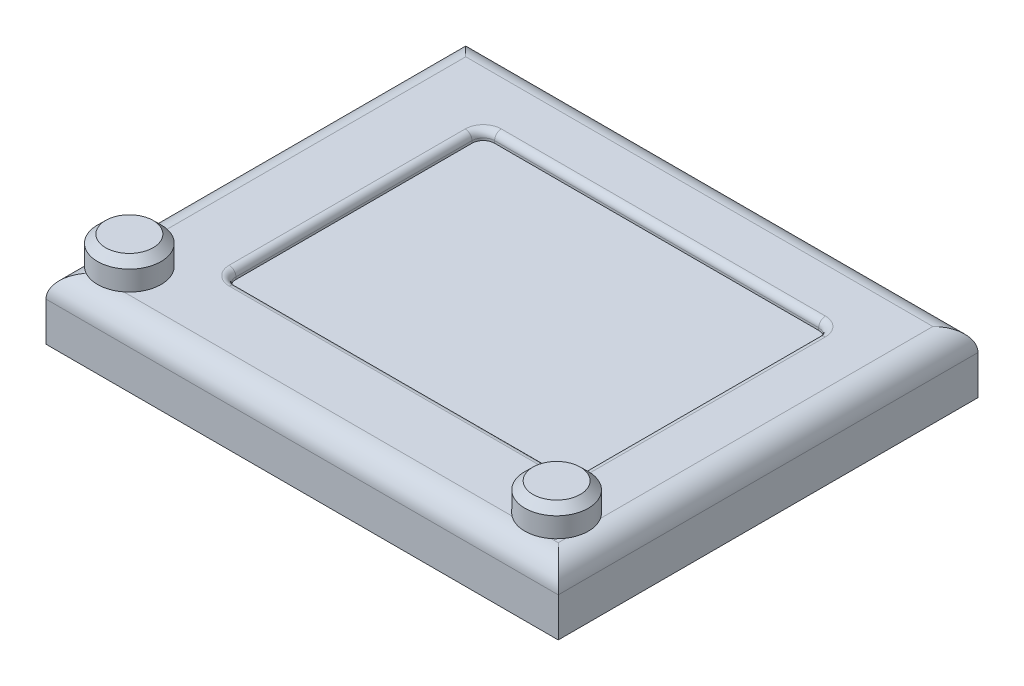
ISO-10303-21;
HEADER;
FILE_DESCRIPTION(('STEP AP214'),'2;1');
FILE_NAME('part.step','',(''),(''),'','','');
FILE_SCHEMA(('AUTOMOTIVE_DESIGN { 1 0 10303 214 1 1 1 1 }'));
ENDSEC;
DATA;
#1=APPLICATION_CONTEXT('core data for automotive mechanical design processes');
#2=APPLICATION_PROTOCOL_DEFINITION('international standard','automotive_design',2000,#1);
#3=PRODUCT_CONTEXT('',#1,'mechanical');
#4=PRODUCT('Part','Part','',(#3));
#5=PRODUCT_RELATED_PRODUCT_CATEGORY('part','',(#4));
#6=PRODUCT_DEFINITION_FORMATION('','',#4);
#7=PRODUCT_DEFINITION_CONTEXT('part definition',#1,'design');
#8=PRODUCT_DEFINITION('design','',#6,#7);
#9=PRODUCT_DEFINITION_SHAPE('','',#8);
#10=(LENGTH_UNIT() NAMED_UNIT(*) SI_UNIT(.MILLI.,.METRE.));
#11=(NAMED_UNIT(*) PLANE_ANGLE_UNIT() SI_UNIT($,.RADIAN.));
#12=(NAMED_UNIT(*) SI_UNIT($,.STERADIAN.) SOLID_ANGLE_UNIT());
#13=UNCERTAINTY_MEASURE_WITH_UNIT(LENGTH_MEASURE(1.E-05),#10,'distance_accuracy_value','');
#14=(GEOMETRIC_REPRESENTATION_CONTEXT(3) GLOBAL_UNCERTAINTY_ASSIGNED_CONTEXT((#13)) GLOBAL_UNIT_ASSIGNED_CONTEXT((#10,
#11,#12)) REPRESENTATION_CONTEXT('',''));
#15=CARTESIAN_POINT('',(0.,0.,0.));
#16=DIRECTION('',(0.,0.,1.));
#17=DIRECTION('',(1.,0.,0.));
#18=AXIS2_PLACEMENT_3D('',#15,#16,#17);
#19=CARTESIAN_POINT('',(3.8875415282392,22.58,-2.9));
#20=DIRECTION('',(0.,1.,0.));
#21=DIRECTION('',(0.,0.,1.));
#22=AXIS2_PLACEMENT_3D('',#19,#20,#21);
#23=PLANE('',#22);
#24=CARTESIAN_POINT('',(-67.9249169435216,22.58,-55.2));
#25=DIRECTION('',(0.,-1.,0.));
#26=DIRECTION('',(0.,0.,-1.));
#27=AXIS2_PLACEMENT_3D('',#24,#25,#26);
#28=CIRCLE('',#27,5.);
#29=CARTESIAN_POINT('',(-67.9249169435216,22.58,-60.2));
#30=VERTEX_POINT('',#29);
#31=CARTESIAN_POINT('',(-72.9249169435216,22.58,-55.2));
#32=VERTEX_POINT('',#31);
#33=EDGE_CURVE('P0_E108',#30,#32,#28,.F.);
#34=ORIENTED_EDGE('',*,*,#33,.T.);
#35=DIRECTION('',(0.,0.,1.));
#36=VECTOR('',#35,1.);
#37=CARTESIAN_POINT('',(-72.9249169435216,22.58,49.4));
#38=LINE('',#37,#36);
#39=CARTESIAN_POINT('',(-72.9249169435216,22.58,49.4));
#40=VERTEX_POINT('',#39);
#41=EDGE_CURVE('P0_E137',#32,#40,#38,.T.);
#42=ORIENTED_EDGE('',*,*,#41,.T.);
#43=CARTESIAN_POINT('',(-67.9249169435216,22.58,49.4));
#44=DIRECTION('',(0.,-1.,0.));
#45=DIRECTION('',(0.,0.,-1.));
#46=AXIS2_PLACEMENT_3D('',#43,#44,#45);
#47=CIRCLE('',#46,5.00000000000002);
#48=CARTESIAN_POINT('',(-67.9249169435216,22.58,54.4));
#49=VERTEX_POINT('',#48);
#50=EDGE_CURVE('P0_E103',#40,#49,#47,.F.);
#51=ORIENTED_EDGE('',*,*,#50,.T.);
#52=DIRECTION('',(1.,0.,0.));
#53=VECTOR('',#52,1.);
#54=CARTESIAN_POINT('',(75.7,22.58,54.4));
#55=LINE('',#54,#53);
#56=CARTESIAN_POINT('',(75.7,22.58,54.4));
#57=VERTEX_POINT('',#56);
#58=EDGE_CURVE('P0_E134',#49,#57,#55,.T.);
#59=ORIENTED_EDGE('',*,*,#58,.T.);
#60=CARTESIAN_POINT('',(75.7,22.58,49.4));
#61=DIRECTION('',(0.,-1.,0.));
#62=DIRECTION('',(0.,0.,-1.));
#63=AXIS2_PLACEMENT_3D('',#60,#61,#62);
#64=CIRCLE('',#63,5.);
#65=CARTESIAN_POINT('',(80.7,22.58,49.4));
#66=VERTEX_POINT('',#65);
#67=EDGE_CURVE('P0_E98',#57,#66,#64,.F.);
#68=ORIENTED_EDGE('',*,*,#67,.T.);
#69=DIRECTION('',(0.,0.,-1.));
#70=VECTOR('',#69,1.);
#71=CARTESIAN_POINT('',(80.7,22.58,-55.2));
#72=LINE('',#71,#70);
#73=CARTESIAN_POINT('',(80.7,22.58,-55.2));
#74=VERTEX_POINT('',#73);
#75=EDGE_CURVE('P0_E102',#66,#74,#72,.T.);
#76=ORIENTED_EDGE('',*,*,#75,.T.);
#77=CARTESIAN_POINT('',(75.7,22.58,-55.2));
#78=DIRECTION('',(0.,-1.,0.));
#79=DIRECTION('',(0.,0.,-1.));
#80=AXIS2_PLACEMENT_3D('',#77,#78,#79);
#81=CIRCLE('',#80,5.00000000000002);
#82=CARTESIAN_POINT('',(75.7,22.58,-60.2));
#83=VERTEX_POINT('',#82);
#84=EDGE_CURVE('P0_E113',#74,#83,#81,.F.);
#85=ORIENTED_EDGE('',*,*,#84,.T.);
#86=DIRECTION('',(-1.,0.,0.));
#87=VECTOR('',#86,1.);
#88=CARTESIAN_POINT('',(-67.9249169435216,22.58,-60.2));
#89=LINE('',#88,#87);
#90=EDGE_CURVE('P0_E142',#83,#30,#89,.T.);
#91=ORIENTED_EDGE('',*,*,#90,.T.);
#92=EDGE_LOOP('',(#34,#42,#51,#59,#68,#76,#85,#91));
#93=FACE_BOUND('',#92,.T.);
#94=ADVANCED_FACE('P0_F41',(#93),#23,.T.);
#95=CARTESIAN_POINT('',(80.7,26.58,-55.2));
#96=DIRECTION('',(1.,0.,0.));
#97=DIRECTION('',(0.,0.,-1.));
#98=AXIS2_PLACEMENT_3D('',#95,#96,#97);
#99=PLANE('',#98);
#100=DIRECTION('',(0.,-1.,0.));
#101=VECTOR('',#100,1.);
#102=CARTESIAN_POINT('',(80.7,26.58,-55.2));
#103=LINE('',#102,#101);
#104=CARTESIAN_POINT('',(80.7,23.58,-55.2));
#105=VERTEX_POINT('',#104);
#106=EDGE_CURVE('P0_E117',#105,#74,#103,.T.);
#107=ORIENTED_EDGE('',*,*,#106,.T.);
#108=ORIENTED_EDGE('',*,*,#75,.F.);
#109=DIRECTION('',(0.,-1.,0.));
#110=VECTOR('',#109,1.);
#111=CARTESIAN_POINT('',(80.7,26.58,49.4));
#112=LINE('',#111,#110);
#113=CARTESIAN_POINT('',(80.7,23.58,49.4));
#114=VERTEX_POINT('',#113);
#115=EDGE_CURVE('P0_E101',#66,#114,#112,.F.);
#116=ORIENTED_EDGE('',*,*,#115,.T.);
#117=DIRECTION('',(0.,0.,1.));
#118=VECTOR('',#117,1.);
#119=CARTESIAN_POINT('',(80.7,23.58,-27.6));
#120=LINE('',#119,#118);
#121=EDGE_CURVE('P0_E207',#105,#114,#120,.T.);
#122=ORIENTED_EDGE('',*,*,#121,.F.);
#123=EDGE_LOOP('',(#107,#108,#116,#122));
#124=FACE_BOUND('',#123,.T.);
#125=ADVANCED_FACE('P0_F484',(#124),#99,.F.);
#126=CARTESIAN_POINT('',(75.7,26.58,49.4));
#127=DIRECTION('',(0.,-1.,0.));
#128=DIRECTION('',(0.,0.,-1.));
#129=AXIS2_PLACEMENT_3D('',#126,#127,#128);
#130=CYLINDRICAL_SURFACE('',#129,5.);
#131=ORIENTED_EDGE('',*,*,#115,.F.);
#132=ORIENTED_EDGE('',*,*,#67,.F.);
#133=DIRECTION('',(0.,1.,0.));
#134=VECTOR('',#133,1.);
#135=CARTESIAN_POINT('',(75.7,26.58,54.4));
#136=LINE('',#135,#134);
#137=CARTESIAN_POINT('',(75.7,23.58,54.4));
#138=VERTEX_POINT('',#137);
#139=EDGE_CURVE('P0_E107',#57,#138,#136,.T.);
#140=ORIENTED_EDGE('',*,*,#139,.T.);
#141=CARTESIAN_POINT('',(75.7,23.58,49.4));
#142=DIRECTION('',(0.,-1.,0.));
#143=DIRECTION('',(0.,0.,-1.));
#144=AXIS2_PLACEMENT_3D('',#141,#142,#143);
#145=CIRCLE('',#144,5.);
#146=EDGE_CURVE('P0_E152',#114,#138,#145,.T.);
#147=ORIENTED_EDGE('',*,*,#146,.F.);
#148=EDGE_LOOP('',(#131,#132,#140,#147));
#149=FACE_BOUND('',#148,.T.);
#150=ADVANCED_FACE('P0_F490',(#149),#130,.F.);
#151=CARTESIAN_POINT('',(75.7,26.58,54.4));
#152=DIRECTION('',(0.,0.,1.));
#153=DIRECTION('',(1.,0.,0.));
#154=AXIS2_PLACEMENT_3D('',#151,#152,#153);
#155=PLANE('',#154);
#156=ORIENTED_EDGE('',*,*,#139,.F.);
#157=ORIENTED_EDGE('',*,*,#58,.F.);
#158=DIRECTION('',(0.,-1.,0.));
#159=VECTOR('',#158,1.);
#160=CARTESIAN_POINT('',(-67.9249169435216,26.58,54.4));
#161=LINE('',#160,#159);
#162=CARTESIAN_POINT('',(-67.9249169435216,23.58,54.4));
#163=VERTEX_POINT('',#162);
#164=EDGE_CURVE('P0_E106',#49,#163,#161,.F.);
#165=ORIENTED_EDGE('',*,*,#164,.T.);
#166=DIRECTION('',(-1.,0.,0.));
#167=VECTOR('',#166,1.);
#168=CARTESIAN_POINT('',(37.85,23.58,54.4));
#169=LINE('',#168,#167);
#170=EDGE_CURVE('P0_E163',#138,#163,#169,.T.);
#171=ORIENTED_EDGE('',*,*,#170,.F.);
#172=EDGE_LOOP('',(#156,#157,#165,#171));
#173=FACE_BOUND('',#172,.T.);
#174=ADVANCED_FACE('P0_F493',(#173),#155,.F.);
#175=CARTESIAN_POINT('',(-67.9249169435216,26.58,49.4));
#176=DIRECTION('',(0.,-1.,0.));
#177=DIRECTION('',(0.,0.,-1.));
#178=AXIS2_PLACEMENT_3D('',#175,#176,#177);
#179=CYLINDRICAL_SURFACE('',#178,5.00000000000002);
#180=ORIENTED_EDGE('',*,*,#164,.F.);
#181=ORIENTED_EDGE('',*,*,#50,.F.);
#182=DIRECTION('',(0.,1.,0.));
#183=VECTOR('',#182,1.);
#184=CARTESIAN_POINT('',(-72.9249169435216,26.58,49.4));
#185=LINE('',#184,#183);
#186=CARTESIAN_POINT('',(-72.9249169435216,23.58,49.4));
#187=VERTEX_POINT('',#186);
#188=EDGE_CURVE('P0_E112',#40,#187,#185,.T.);
#189=ORIENTED_EDGE('',*,*,#188,.T.);
#190=CARTESIAN_POINT('',(-67.9249169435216,23.58,49.4));
#191=DIRECTION('',(0.,-1.,0.));
#192=DIRECTION('',(0.,0.,-1.));
#193=AXIS2_PLACEMENT_3D('',#190,#191,#192);
#194=CIRCLE('',#193,5.00000000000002);
#195=EDGE_CURVE('P0_E173',#163,#187,#194,.T.);
#196=ORIENTED_EDGE('',*,*,#195,.F.);
#197=EDGE_LOOP('',(#180,#181,#189,#196));
#198=FACE_BOUND('',#197,.T.);
#199=ADVANCED_FACE('P0_F498',(#198),#179,.F.);
#200=CARTESIAN_POINT('',(-72.9249169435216,26.58,49.4));
#201=DIRECTION('',(-1.,0.,0.));
#202=DIRECTION('',(0.,0.,1.));
#203=AXIS2_PLACEMENT_3D('',#200,#201,#202);
#204=PLANE('',#203);
#205=ORIENTED_EDGE('',*,*,#188,.F.);
#206=ORIENTED_EDGE('',*,*,#41,.F.);
#207=DIRECTION('',(0.,-1.,0.));
#208=VECTOR('',#207,1.);
#209=CARTESIAN_POINT('',(-72.9249169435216,26.58,-55.2));
#210=LINE('',#209,#208);
#211=CARTESIAN_POINT('',(-72.9249169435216,23.58,-55.2));
#212=VERTEX_POINT('',#211);
#213=EDGE_CURVE('P0_E111',#32,#212,#210,.F.);
#214=ORIENTED_EDGE('',*,*,#213,.T.);
#215=DIRECTION('',(0.,0.,-1.));
#216=VECTOR('',#215,1.);
#217=CARTESIAN_POINT('',(-72.9249169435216,23.58,24.7));
#218=LINE('',#217,#216);
#219=EDGE_CURVE('P0_E183',#187,#212,#218,.T.);
#220=ORIENTED_EDGE('',*,*,#219,.F.);
#221=EDGE_LOOP('',(#205,#206,#214,#220));
#222=FACE_BOUND('',#221,.T.);
#223=ADVANCED_FACE('P0_F657',(#222),#204,.F.);
#224=CARTESIAN_POINT('',(-67.9249169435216,26.58,-55.2));
#225=DIRECTION('',(0.,-1.,0.));
#226=DIRECTION('',(0.,0.,-1.));
#227=AXIS2_PLACEMENT_3D('',#224,#225,#226);
#228=CYLINDRICAL_SURFACE('',#227,5.);
#229=ORIENTED_EDGE('',*,*,#213,.F.);
#230=ORIENTED_EDGE('',*,*,#33,.F.);
#231=DIRECTION('',(0.,1.,0.));
#232=VECTOR('',#231,1.);
#233=CARTESIAN_POINT('',(-67.9249169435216,26.58,-60.2));
#234=LINE('',#233,#232);
#235=CARTESIAN_POINT('',(-67.9249169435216,23.58,-60.2));
#236=VERTEX_POINT('',#235);
#237=EDGE_CURVE('P0_E145',#30,#236,#234,.T.);
#238=ORIENTED_EDGE('',*,*,#237,.T.);
#239=CARTESIAN_POINT('',(-67.9249169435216,23.58,-55.2));
#240=DIRECTION('',(0.,-1.,0.));
#241=DIRECTION('',(0.,0.,-1.));
#242=AXIS2_PLACEMENT_3D('',#239,#240,#241);
#243=CIRCLE('',#242,5.);
#244=EDGE_CURVE('P0_E193',#212,#236,#243,.T.);
#245=ORIENTED_EDGE('',*,*,#244,.F.);
#246=EDGE_LOOP('',(#229,#230,#238,#245));
#247=FACE_BOUND('',#246,.T.);
#248=ADVANCED_FACE('P0_F648',(#247),#228,.F.);
#249=CARTESIAN_POINT('',(-67.9249169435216,26.58,-60.2));
#250=DIRECTION('',(0.,0.,-1.));
#251=DIRECTION('',(-1.,0.,0.));
#252=AXIS2_PLACEMENT_3D('',#249,#250,#251);
#253=PLANE('',#252);
#254=ORIENTED_EDGE('',*,*,#237,.F.);
#255=ORIENTED_EDGE('',*,*,#90,.F.);
#256=DIRECTION('',(0.,-1.,0.));
#257=VECTOR('',#256,1.);
#258=CARTESIAN_POINT('',(75.7,26.58,-60.2));
#259=LINE('',#258,#257);
#260=CARTESIAN_POINT('',(75.7,23.58,-60.2));
#261=VERTEX_POINT('',#260);
#262=EDGE_CURVE('P0_E116',#83,#261,#259,.F.);
#263=ORIENTED_EDGE('',*,*,#262,.T.);
#264=DIRECTION('',(1.,0.,0.));
#265=VECTOR('',#264,1.);
#266=CARTESIAN_POINT('',(-33.9624584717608,23.58,-60.2));
#267=LINE('',#266,#265);
#268=EDGE_CURVE('P0_E223',#236,#261,#267,.T.);
#269=ORIENTED_EDGE('',*,*,#268,.F.);
#270=EDGE_LOOP('',(#254,#255,#263,#269));
#271=FACE_BOUND('',#270,.T.);
#272=ADVANCED_FACE('P0_F640',(#271),#253,.F.);
#273=CARTESIAN_POINT('',(75.7,26.58,-55.2));
#274=DIRECTION('',(0.,-1.,0.));
#275=DIRECTION('',(0.,0.,-1.));
#276=AXIS2_PLACEMENT_3D('',#273,#274,#275);
#277=CYLINDRICAL_SURFACE('',#276,5.00000000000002);
#278=ORIENTED_EDGE('',*,*,#262,.F.);
#279=ORIENTED_EDGE('',*,*,#84,.F.);
#280=ORIENTED_EDGE('',*,*,#106,.F.);
#281=CARTESIAN_POINT('',(75.7,23.58,-55.2));
#282=DIRECTION('',(0.,-1.,0.));
#283=DIRECTION('',(0.,0.,-1.));
#284=AXIS2_PLACEMENT_3D('',#281,#282,#283);
#285=CIRCLE('',#284,5.00000000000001);
#286=EDGE_CURVE('P0_E212',#261,#105,#285,.T.);
#287=ORIENTED_EDGE('',*,*,#286,.F.);
#288=EDGE_LOOP('',(#278,#279,#280,#287));
#289=FACE_BOUND('',#288,.T.);
#290=ADVANCED_FACE('P0_F632',(#289),#277,.F.);
#291=CARTESIAN_POINT('',(83.7,23.58,-27.6));
#292=DIRECTION('',(0.,0.,1.));
#293=DIRECTION('',(1.,0.,0.));
#294=AXIS2_PLACEMENT_3D('',#291,#292,#293);
#295=CYLINDRICAL_SURFACE('',#294,3.);
#296=CARTESIAN_POINT('',(83.7,23.58,49.4));
#297=DIRECTION('',(0.,0.,1.));
#298=DIRECTION('',(1.,0.,0.));
#299=AXIS2_PLACEMENT_3D('',#296,#297,#298);
#300=CIRCLE('',#299,3.);
#301=CARTESIAN_POINT('',(83.7,26.58,49.4));
#302=VERTEX_POINT('',#301);
#303=EDGE_CURVE('P0_E156',#302,#114,#300,.T.);
#304=ORIENTED_EDGE('',*,*,#303,.F.);
#305=DIRECTION('',(0.,0.,1.));
#306=VECTOR('',#305,1.);
#307=CARTESIAN_POINT('',(83.7,26.58,0.));
#308=LINE('',#307,#306);
#309=CARTESIAN_POINT('',(83.7,26.58,-55.2));
#310=VERTEX_POINT('',#309);
#311=EDGE_CURVE('P0_E215',#310,#302,#308,.T.);
#312=ORIENTED_EDGE('',*,*,#311,.F.);
#313=CARTESIAN_POINT('',(83.7,23.58,-55.2));
#314=DIRECTION('',(0.,0.,1.));
#315=DIRECTION('',(1.,0.,0.));
#316=AXIS2_PLACEMENT_3D('',#313,#314,#315);
#317=CIRCLE('',#316,3.);
#318=EDGE_CURVE('P0_E226',#105,#310,#317,.F.);
#319=ORIENTED_EDGE('',*,*,#318,.F.);
#320=ORIENTED_EDGE('',*,*,#121,.T.);
#321=EDGE_LOOP('',(#304,#312,#319,#320));
#322=FACE_BOUND('',#321,.T.);
#323=ADVANCED_FACE('P0_F248',(#322),#295,.T.);
#324=CARTESIAN_POINT('',(75.7,23.58,49.4));
#325=DIRECTION('',(0.,-1.,0.));
#326=DIRECTION('',(0.,0.,-1.));
#327=AXIS2_PLACEMENT_3D('',#324,#325,#326);
#328=TOROIDAL_SURFACE('',#327,8.,3.);
#329=ORIENTED_EDGE('',*,*,#303,.T.);
#330=ORIENTED_EDGE('',*,*,#146,.T.);
#331=CARTESIAN_POINT('',(75.7,23.58,57.4));
#332=DIRECTION('',(-1.,0.,0.));
#333=DIRECTION('',(0.,0.,1.));
#334=AXIS2_PLACEMENT_3D('',#331,#332,#333);
#335=CIRCLE('',#334,3.);
#336=CARTESIAN_POINT('',(75.7,26.58,57.4));
#337=VERTEX_POINT('',#336);
#338=EDGE_CURVE('P0_E155',#337,#138,#335,.T.);
#339=ORIENTED_EDGE('',*,*,#338,.F.);
#340=CARTESIAN_POINT('',(75.7,26.58,49.4));
#341=DIRECTION('',(0.,1.,0.));
#342=DIRECTION('',(0.,0.,1.));
#343=AXIS2_PLACEMENT_3D('',#340,#341,#342);
#344=CIRCLE('',#343,7.99999999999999);
#345=EDGE_CURVE('P0_E344',#302,#337,#344,.F.);
#346=ORIENTED_EDGE('',*,*,#345,.F.);
#347=EDGE_LOOP('',(#329,#330,#339,#346));
#348=FACE_BOUND('',#347,.T.);
#349=ADVANCED_FACE('P0_F237',(#348),#328,.T.);
#350=CARTESIAN_POINT('',(37.85,23.58,57.4));
#351=DIRECTION('',(-1.,0.,0.));
#352=DIRECTION('',(0.,0.,1.));
#353=AXIS2_PLACEMENT_3D('',#350,#351,#352);
#354=CYLINDRICAL_SURFACE('',#353,3.);
#355=ORIENTED_EDGE('',*,*,#338,.T.);
#356=ORIENTED_EDGE('',*,*,#170,.T.);
#357=CARTESIAN_POINT('',(-67.9249169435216,23.58,57.4));
#358=DIRECTION('',(-1.,0.,0.));
#359=DIRECTION('',(0.,0.,1.));
#360=AXIS2_PLACEMENT_3D('',#357,#358,#359);
#361=CIRCLE('',#360,3.);
#362=CARTESIAN_POINT('',(-67.9249169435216,26.58,57.4));
#363=VERTEX_POINT('',#362);
#364=EDGE_CURVE('P0_E166',#363,#163,#361,.T.);
#365=ORIENTED_EDGE('',*,*,#364,.F.);
#366=DIRECTION('',(1.,0.,0.));
#367=VECTOR('',#366,1.);
#368=CARTESIAN_POINT('',(0.,26.58,57.4));
#369=LINE('',#368,#367);
#370=EDGE_CURVE('P0_E347',#337,#363,#369,.F.);
#371=ORIENTED_EDGE('',*,*,#370,.F.);
#372=EDGE_LOOP('',(#355,#356,#365,#371));
#373=FACE_BOUND('',#372,.T.);
#374=ADVANCED_FACE('P0_F247',(#373),#354,.T.);
#375=CARTESIAN_POINT('',(-67.9249169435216,23.58,49.4));
#376=DIRECTION('',(0.,-1.,0.));
#377=DIRECTION('',(0.,0.,-1.));
#378=AXIS2_PLACEMENT_3D('',#375,#376,#377);
#379=TOROIDAL_SURFACE('',#378,8.00000000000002,3.);
#380=ORIENTED_EDGE('',*,*,#364,.T.);
#381=ORIENTED_EDGE('',*,*,#195,.T.);
#382=CARTESIAN_POINT('',(-75.9249169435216,23.58,49.4));
#383=DIRECTION('',(0.,0.,-1.));
#384=DIRECTION('',(-1.,0.,0.));
#385=AXIS2_PLACEMENT_3D('',#382,#383,#384);
#386=CIRCLE('',#385,3.);
#387=CARTESIAN_POINT('',(-75.9249169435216,26.58,49.4));
#388=VERTEX_POINT('',#387);
#389=EDGE_CURVE('P0_E176',#388,#187,#386,.T.);
#390=ORIENTED_EDGE('',*,*,#389,.F.);
#391=CARTESIAN_POINT('',(-67.9249169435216,26.58,49.4));
#392=DIRECTION('',(0.,1.,0.));
#393=DIRECTION('',(-1.,0.,0.));
#394=AXIS2_PLACEMENT_3D('',#391,#392,#393);
#395=CIRCLE('',#394,8.00000000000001);
#396=EDGE_CURVE('P0_E350',#363,#388,#395,.F.);
#397=ORIENTED_EDGE('',*,*,#396,.F.);
#398=EDGE_LOOP('',(#380,#381,#390,#397));
#399=FACE_BOUND('',#398,.T.);
#400=ADVANCED_FACE('P0_F267',(#399),#379,.T.);
#401=CARTESIAN_POINT('',(-75.9249169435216,23.58,24.7));
#402=DIRECTION('',(0.,0.,-1.));
#403=DIRECTION('',(-1.,0.,0.));
#404=AXIS2_PLACEMENT_3D('',#401,#402,#403);
#405=CYLINDRICAL_SURFACE('',#404,3.);
#406=ORIENTED_EDGE('',*,*,#389,.T.);
#407=ORIENTED_EDGE('',*,*,#219,.T.);
#408=CARTESIAN_POINT('',(-75.9249169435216,23.58,-55.2));
#409=DIRECTION('',(0.,0.,-1.));
#410=DIRECTION('',(-1.,0.,0.));
#411=AXIS2_PLACEMENT_3D('',#408,#409,#410);
#412=CIRCLE('',#411,3.);
#413=CARTESIAN_POINT('',(-75.9249169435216,26.58,-55.2));
#414=VERTEX_POINT('',#413);
#415=EDGE_CURVE('P0_E186',#414,#212,#412,.T.);
#416=ORIENTED_EDGE('',*,*,#415,.F.);
#417=DIRECTION('',(0.,0.,1.));
#418=VECTOR('',#417,1.);
#419=CARTESIAN_POINT('',(-75.9249169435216,26.58,0.));
#420=LINE('',#419,#418);
#421=EDGE_CURVE('P0_E353',#388,#414,#420,.F.);
#422=ORIENTED_EDGE('',*,*,#421,.F.);
#423=EDGE_LOOP('',(#406,#407,#416,#422));
#424=FACE_BOUND('',#423,.T.);
#425=ADVANCED_FACE('P0_F276',(#424),#405,.T.);
#426=CARTESIAN_POINT('',(-67.9249169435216,23.58,-55.2));
#427=DIRECTION('',(0.,-1.,0.));
#428=DIRECTION('',(0.,0.,-1.));
#429=AXIS2_PLACEMENT_3D('',#426,#427,#428);
#430=TOROIDAL_SURFACE('',#429,8.,3.);
#431=ORIENTED_EDGE('',*,*,#415,.T.);
#432=ORIENTED_EDGE('',*,*,#244,.T.);
#433=CARTESIAN_POINT('',(-67.9249169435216,23.58,-63.2));
#434=DIRECTION('',(1.,0.,0.));
#435=DIRECTION('',(0.,0.,-1.));
#436=AXIS2_PLACEMENT_3D('',#433,#434,#435);
#437=CIRCLE('',#436,3.);
#438=CARTESIAN_POINT('',(-67.9249169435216,26.58,-63.2));
#439=VERTEX_POINT('',#438);
#440=EDGE_CURVE('P0_E196',#439,#236,#437,.T.);
#441=ORIENTED_EDGE('',*,*,#440,.F.);
#442=CARTESIAN_POINT('',(-67.9249169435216,26.58,-55.2));
#443=DIRECTION('',(0.,1.,0.));
#444=DIRECTION('',(0.,0.,-1.));
#445=AXIS2_PLACEMENT_3D('',#442,#443,#444);
#446=CIRCLE('',#445,8.);
#447=EDGE_CURVE('P0_E356',#414,#439,#446,.F.);
#448=ORIENTED_EDGE('',*,*,#447,.F.);
#449=EDGE_LOOP('',(#431,#432,#441,#448));
#450=FACE_BOUND('',#449,.T.);
#451=ADVANCED_FACE('P0_F294',(#450),#430,.T.);
#452=CARTESIAN_POINT('',(-33.9624584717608,23.58,-63.2));
#453=DIRECTION('',(1.,0.,0.));
#454=DIRECTION('',(0.,0.,-1.));
#455=AXIS2_PLACEMENT_3D('',#452,#453,#454);
#456=CYLINDRICAL_SURFACE('',#455,3.);
#457=ORIENTED_EDGE('',*,*,#440,.T.);
#458=ORIENTED_EDGE('',*,*,#268,.T.);
#459=CARTESIAN_POINT('',(75.7,23.58,-63.2));
#460=DIRECTION('',(1.,0.,0.));
#461=DIRECTION('',(0.,0.,-1.));
#462=AXIS2_PLACEMENT_3D('',#459,#460,#461);
#463=CIRCLE('',#462,3.);
#464=CARTESIAN_POINT('',(75.7,26.58,-63.2));
#465=VERTEX_POINT('',#464);
#466=EDGE_CURVE('P0_E216',#465,#261,#463,.T.);
#467=ORIENTED_EDGE('',*,*,#466,.F.);
#468=DIRECTION('',(1.,0.,0.));
#469=VECTOR('',#468,1.);
#470=CARTESIAN_POINT('',(0.,26.58,-63.2));
#471=LINE('',#470,#469);
#472=EDGE_CURVE('P0_E359',#439,#465,#471,.T.);
#473=ORIENTED_EDGE('',*,*,#472,.F.);
#474=EDGE_LOOP('',(#457,#458,#467,#473));
#475=FACE_BOUND('',#474,.T.);
#476=ADVANCED_FACE('P0_F303',(#475),#456,.T.);
#477=CARTESIAN_POINT('',(75.7,23.58,-55.2));
#478=DIRECTION('',(0.,-1.,0.));
#479=DIRECTION('',(0.,0.,-1.));
#480=AXIS2_PLACEMENT_3D('',#477,#478,#479);
#481=TOROIDAL_SURFACE('',#480,8.00000000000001,3.);
#482=ORIENTED_EDGE('',*,*,#466,.T.);
#483=ORIENTED_EDGE('',*,*,#286,.T.);
#484=ORIENTED_EDGE('',*,*,#318,.T.);
#485=CARTESIAN_POINT('',(75.7,26.58,-55.2));
#486=DIRECTION('',(0.,1.,0.));
#487=DIRECTION('',(1.,0.,0.));
#488=AXIS2_PLACEMENT_3D('',#485,#486,#487);
#489=CIRCLE('',#488,8.00000000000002);
#490=EDGE_CURVE('P0_E362',#465,#310,#489,.F.);
#491=ORIENTED_EDGE('',*,*,#490,.F.);
#492=EDGE_LOOP('',(#482,#483,#484,#491));
#493=FACE_BOUND('',#492,.T.);
#494=ADVANCED_FACE('P0_F325',(#493),#481,.T.);
#495=CARTESIAN_POINT('',(0.,26.58,0.));
#496=DIRECTION('',(0.,1.,0.));
#497=DIRECTION('',(0.,0.,1.));
#498=AXIS2_PLACEMENT_3D('',#495,#496,#497);
#499=PLANE('',#498);
#500=ORIENTED_EDGE('',*,*,#472,.T.);
#501=ORIENTED_EDGE('',*,*,#490,.T.);
#502=ORIENTED_EDGE('',*,*,#311,.T.);
#503=ORIENTED_EDGE('',*,*,#345,.T.);
#504=ORIENTED_EDGE('',*,*,#370,.T.);
#505=ORIENTED_EDGE('',*,*,#396,.T.);
#506=ORIENTED_EDGE('',*,*,#421,.T.);
#507=ORIENTED_EDGE('',*,*,#447,.T.);
#508=EDGE_LOOP('',(#500,#501,#502,#503,#504,#505,#506,#507));
#509=FACE_BOUND('',#508,.T.);
#510=DIRECTION('',(0.,0.,1.));
#511=VECTOR('',#510,1.);
#512=CARTESIAN_POINT('',(-103.5,26.58,-46.5));
#513=LINE('',#512,#511);
#514=CARTESIAN_POINT('',(-103.5,26.58,83.));
#515=VERTEX_POINT('',#514);
#516=CARTESIAN_POINT('',(-103.5,26.58,-83.));
#517=VERTEX_POINT('',#516);
#518=EDGE_CURVE('P0_E122',#515,#517,#513,.F.);
#519=ORIENTED_EDGE('',*,*,#518,.F.);
#520=DIRECTION('',(1.,0.,0.));
#521=VECTOR('',#520,1.);
#522=CARTESIAN_POINT('',(-56.75,26.58,83.));
#523=LINE('',#522,#521);
#524=CARTESIAN_POINT('',(103.5,26.58,83.));
#525=VERTEX_POINT('',#524);
#526=EDGE_CURVE('P0_E121',#525,#515,#523,.F.);
#527=ORIENTED_EDGE('',*,*,#526,.F.);
#528=DIRECTION('',(0.,0.,-1.));
#529=VECTOR('',#528,1.);
#530=CARTESIAN_POINT('',(103.5,26.58,46.5));
#531=LINE('',#530,#529);
#532=CARTESIAN_POINT('',(103.5,26.58,-83.));
#533=VERTEX_POINT('',#532);
#534=EDGE_CURVE('P0_E126',#533,#525,#531,.F.);
#535=ORIENTED_EDGE('',*,*,#534,.F.);
#536=DIRECTION('',(-1.,0.,0.));
#537=VECTOR('',#536,1.);
#538=CARTESIAN_POINT('',(56.75,26.58,-83.));
#539=LINE('',#538,#537);
#540=EDGE_CURVE('P0_E412',#517,#533,#539,.F.);
#541=ORIENTED_EDGE('',*,*,#540,.F.);
#542=EDGE_LOOP('',(#519,#527,#535,#541));
#543=FACE_BOUND('',#542,.T.);
#544=ADVANCED_FACE('P0_F334',(#509,#543),#499,.T.);
#545=CARTESIAN_POINT('',(56.75,16.58,-83.));
#546=DIRECTION('',(-1.,0.,0.));
#547=DIRECTION('',(0.,0.,1.));
#548=AXIS2_PLACEMENT_3D('',#545,#546,#547);
#549=CYLINDRICAL_SURFACE('',#548,10.);
#550=ORIENTED_EDGE('',*,*,#540,.T.);
#551=CARTESIAN_POINT('',(103.5,16.58,-83.));
#552=DIRECTION('',(-0.707106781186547,0.,-0.707106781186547));
#553=DIRECTION('',(0.707106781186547,0.,-0.707106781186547));
#554=AXIS2_PLACEMENT_3D('',#551,#552,#553);
#555=ELLIPSE('',#554,14.1421356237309,10.);
#556=CARTESIAN_POINT('',(113.5,16.58,-93.));
#557=VERTEX_POINT('',#556);
#558=EDGE_CURVE('P0_E130',#557,#533,#555,.F.);
#559=ORIENTED_EDGE('',*,*,#558,.F.);
#560=DIRECTION('',(-1.,0.,0.));
#561=VECTOR('',#560,1.);
#562=CARTESIAN_POINT('',(113.5,16.58,-93.));
#563=LINE('',#562,#561);
#564=CARTESIAN_POINT('',(-113.5,16.58,-93.));
#565=VERTEX_POINT('',#564);
#566=EDGE_CURVE('P0_E133',#565,#557,#563,.F.);
#567=ORIENTED_EDGE('',*,*,#566,.F.);
#568=CARTESIAN_POINT('',(-103.5,16.58,-83.));
#569=DIRECTION('',(-0.707106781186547,0.,0.707106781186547));
#570=DIRECTION('',(0.707106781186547,0.,0.707106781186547));
#571=AXIS2_PLACEMENT_3D('',#568,#569,#570);
#572=ELLIPSE('',#571,14.1421356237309,10.);
#573=EDGE_CURVE('P0_E118',#517,#565,#572,.T.);
#574=ORIENTED_EDGE('',*,*,#573,.F.);
#575=EDGE_LOOP('',(#550,#559,#567,#574));
#576=FACE_BOUND('',#575,.T.);
#577=ADVANCED_FACE('P0_F532',(#576),#549,.T.);
#578=CARTESIAN_POINT('',(-103.5,16.58,-46.5));
#579=DIRECTION('',(0.,0.,1.));
#580=DIRECTION('',(1.,0.,0.));
#581=AXIS2_PLACEMENT_3D('',#578,#579,#580);
#582=CYLINDRICAL_SURFACE('',#581,10.);
#583=DIRECTION('',(0.,0.,1.));
#584=VECTOR('',#583,1.);
#585=CARTESIAN_POINT('',(-113.5,16.58,-93.));
#586=LINE('',#585,#584);
#587=CARTESIAN_POINT('',(-113.5,16.58,93.));
#588=VERTEX_POINT('',#587);
#589=EDGE_CURVE('P0_E80',#588,#565,#586,.F.);
#590=ORIENTED_EDGE('',*,*,#589,.F.);
#591=CARTESIAN_POINT('',(-103.5,16.58,83.));
#592=DIRECTION('',(0.707106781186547,0.,0.707106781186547));
#593=DIRECTION('',(0.707106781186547,0.,-0.707106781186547));
#594=AXIS2_PLACEMENT_3D('',#591,#592,#593);
#595=ELLIPSE('',#594,14.1421356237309,10.);
#596=EDGE_CURVE('P0_E123',#515,#588,#595,.T.);
#597=ORIENTED_EDGE('',*,*,#596,.F.);
#598=ORIENTED_EDGE('',*,*,#518,.T.);
#599=ORIENTED_EDGE('',*,*,#573,.T.);
#600=EDGE_LOOP('',(#590,#597,#598,#599));
#601=FACE_BOUND('',#600,.T.);
#602=ADVANCED_FACE('P0_F534',(#601),#582,.T.);
#603=CARTESIAN_POINT('',(-56.75,16.58,83.));
#604=DIRECTION('',(1.,0.,0.));
#605=DIRECTION('',(0.,0.,-1.));
#606=AXIS2_PLACEMENT_3D('',#603,#604,#605);
#607=CYLINDRICAL_SURFACE('',#606,10.);
#608=DIRECTION('',(1.,0.,0.));
#609=VECTOR('',#608,1.);
#610=CARTESIAN_POINT('',(-113.5,16.58,93.));
#611=LINE('',#610,#609);
#612=CARTESIAN_POINT('',(113.5,16.58,93.));
#613=VERTEX_POINT('',#612);
#614=EDGE_CURVE('P0_E85',#613,#588,#611,.F.);
#615=ORIENTED_EDGE('',*,*,#614,.F.);
#616=CARTESIAN_POINT('',(103.5,16.58,83.));
#617=DIRECTION('',(0.707106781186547,0.,-0.707106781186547));
#618=DIRECTION('',(-0.707106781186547,0.,-0.707106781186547));
#619=AXIS2_PLACEMENT_3D('',#616,#617,#618);
#620=ELLIPSE('',#619,14.1421356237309,10.);
#621=EDGE_CURVE('P0_E127',#525,#613,#620,.T.);
#622=ORIENTED_EDGE('',*,*,#621,.F.);
#623=ORIENTED_EDGE('',*,*,#526,.T.);
#624=ORIENTED_EDGE('',*,*,#596,.T.);
#625=EDGE_LOOP('',(#615,#622,#623,#624));
#626=FACE_BOUND('',#625,.T.);
#627=ADVANCED_FACE('P0_F446',(#626),#607,.T.);
#628=CARTESIAN_POINT('',(103.5,16.58,46.5));
#629=DIRECTION('',(0.,0.,-1.));
#630=DIRECTION('',(-1.,0.,0.));
#631=AXIS2_PLACEMENT_3D('',#628,#629,#630);
#632=CYLINDRICAL_SURFACE('',#631,10.);
#633=DIRECTION('',(0.,0.,-1.));
#634=VECTOR('',#633,1.);
#635=CARTESIAN_POINT('',(113.5,16.58,93.));
#636=LINE('',#635,#634);
#637=EDGE_CURVE('P0_E419',#557,#613,#636,.F.);
#638=ORIENTED_EDGE('',*,*,#637,.F.);
#639=ORIENTED_EDGE('',*,*,#558,.T.);
#640=ORIENTED_EDGE('',*,*,#534,.T.);
#641=ORIENTED_EDGE('',*,*,#621,.T.);
#642=EDGE_LOOP('',(#638,#639,#640,#641));
#643=FACE_BOUND('',#642,.T.);
#644=ADVANCED_FACE('P0_F434',(#643),#632,.T.);
#645=CARTESIAN_POINT('',(113.5,0.,-93.));
#646=DIRECTION('',(0.,0.,-1.));
#647=DIRECTION('',(-1.,0.,0.));
#648=AXIS2_PLACEMENT_3D('',#645,#646,#647);
#649=PLANE('',#648);
#650=DIRECTION('',(1.,0.,0.));
#651=VECTOR('',#650,1.);
#652=CARTESIAN_POINT('',(0.,-0.7366,-93.));
#653=LINE('',#652,#651);
#654=CARTESIAN_POINT('',(113.5,-0.7366,-93.));
#655=VERTEX_POINT('',#654);
#656=CARTESIAN_POINT('',(-113.5,-0.7366,-93.));
#657=VERTEX_POINT('',#656);
#658=EDGE_CURVE('P0_E89',#655,#657,#653,.F.);
#659=ORIENTED_EDGE('',*,*,#658,.T.);
#660=DIRECTION('',(0.,1.,0.));
#661=VECTOR('',#660,1.);
#662=CARTESIAN_POINT('',(-113.5,0.,-93.));
#663=LINE('',#662,#661);
#664=EDGE_CURVE('P0_E74',#565,#657,#663,.F.);
#665=ORIENTED_EDGE('',*,*,#664,.F.);
#666=ORIENTED_EDGE('',*,*,#566,.T.);
#667=DIRECTION('',(0.,1.,0.));
#668=VECTOR('',#667,1.);
#669=CARTESIAN_POINT('',(113.5,0.,-93.));
#670=LINE('',#669,#668);
#671=EDGE_CURVE('P0_E94',#655,#557,#670,.T.);
#672=ORIENTED_EDGE('',*,*,#671,.F.);
#673=EDGE_LOOP('',(#659,#665,#666,#672));
#674=FACE_BOUND('',#673,.T.);
#675=ADVANCED_FACE('P0_F92',(#674),#649,.T.);
#676=CARTESIAN_POINT('',(-113.5,0.,-93.));
#677=DIRECTION('',(-1.,0.,0.));
#678=DIRECTION('',(0.,0.,1.));
#679=AXIS2_PLACEMENT_3D('',#676,#677,#678);
#680=PLANE('',#679);
#681=DIRECTION('',(0.,0.,1.));
#682=VECTOR('',#681,1.);
#683=CARTESIAN_POINT('',(-113.5,-0.7366,0.));
#684=LINE('',#683,#682);
#685=CARTESIAN_POINT('',(-113.5,-0.7366,93.));
#686=VERTEX_POINT('',#685);
#687=EDGE_CURVE('P0_E45',#657,#686,#684,.T.);
#688=ORIENTED_EDGE('',*,*,#687,.T.);
#689=DIRECTION('',(0.,1.,0.));
#690=VECTOR('',#689,1.);
#691=CARTESIAN_POINT('',(-113.5,0.,93.));
#692=LINE('',#691,#690);
#693=EDGE_CURVE('P0_E417',#588,#686,#692,.F.);
#694=ORIENTED_EDGE('',*,*,#693,.F.);
#695=ORIENTED_EDGE('',*,*,#589,.T.);
#696=ORIENTED_EDGE('',*,*,#664,.T.);
#697=EDGE_LOOP('',(#688,#694,#695,#696));
#698=FACE_BOUND('',#697,.T.);
#699=ADVANCED_FACE('P0_F76',(#698),#680,.T.);
#700=CARTESIAN_POINT('',(-113.5,0.,93.));
#701=DIRECTION('',(0.,0.,1.));
#702=DIRECTION('',(1.,0.,0.));
#703=AXIS2_PLACEMENT_3D('',#700,#701,#702);
#704=PLANE('',#703);
#705=DIRECTION('',(1.,0.,0.));
#706=VECTOR('',#705,1.);
#707=CARTESIAN_POINT('',(0.,-0.7366,93.));
#708=LINE('',#707,#706);
#709=CARTESIAN_POINT('',(113.5,-0.7366,93.));
#710=VERTEX_POINT('',#709);
#711=EDGE_CURVE('P0_E51',#686,#710,#708,.T.);
#712=ORIENTED_EDGE('',*,*,#711,.T.);
#713=DIRECTION('',(0.,1.,0.));
#714=VECTOR('',#713,1.);
#715=CARTESIAN_POINT('',(113.5,0.,93.));
#716=LINE('',#715,#714);
#717=EDGE_CURVE('P0_E58',#613,#710,#716,.F.);
#718=ORIENTED_EDGE('',*,*,#717,.F.);
#719=ORIENTED_EDGE('',*,*,#614,.T.);
#720=ORIENTED_EDGE('',*,*,#693,.T.);
#721=EDGE_LOOP('',(#712,#718,#719,#720));
#722=FACE_BOUND('',#721,.T.);
#723=ADVANCED_FACE('P0_F451',(#722),#704,.T.);
#724=CARTESIAN_POINT('',(113.5,0.,93.));
#725=DIRECTION('',(1.,0.,0.));
#726=DIRECTION('',(0.,0.,-1.));
#727=AXIS2_PLACEMENT_3D('',#724,#725,#726);
#728=PLANE('',#727);
#729=DIRECTION('',(0.,0.,1.));
#730=VECTOR('',#729,1.);
#731=CARTESIAN_POINT('',(113.5,-0.7366,0.));
#732=LINE('',#731,#730);
#733=EDGE_CURVE('P0_E12',#710,#655,#732,.F.);
#734=ORIENTED_EDGE('',*,*,#733,.T.);
#735=ORIENTED_EDGE('',*,*,#671,.T.);
#736=ORIENTED_EDGE('',*,*,#637,.T.);
#737=ORIENTED_EDGE('',*,*,#717,.T.);
#738=EDGE_LOOP('',(#734,#735,#736,#737));
#739=FACE_BOUND('',#738,.T.);
#740=ADVANCED_FACE('P0_F543',(#739),#728,.T.);
#741=CARTESIAN_POINT('',(0.,-0.7366,0.));
#742=DIRECTION('',(0.,1.,0.));
#743=DIRECTION('',(0.,0.,1.));
#744=AXIS2_PLACEMENT_3D('',#741,#742,#743);
#745=PLANE('',#744);
#746=ORIENTED_EDGE('',*,*,#711,.F.);
#747=ORIENTED_EDGE('',*,*,#687,.F.);
#748=ORIENTED_EDGE('',*,*,#658,.F.);
#749=ORIENTED_EDGE('',*,*,#733,.F.);
#750=EDGE_LOOP('',(#746,#747,#748,#749));
#751=FACE_BOUND('',#750,.T.);
#752=ADVANCED_FACE('P0_F43',(#751),#745,.F.);
#753=CLOSED_SHELL('',(#94,#125,#150,#174,#199,#223,#248,#272,#290,#323,#349,#374,#400,#425,#451,
#476,#494,#544,#577,#602,#627,#644,#675,#699,#723,#740,#752));
#754=MANIFOLD_SOLID_BREP('P0_B2',#753);
#755=CARTESIAN_POINT('',(-84.165,41.9,74.895));
#756=DIRECTION('',(0.,1.,0.));
#757=DIRECTION('',(0.,0.,1.));
#758=AXIS2_PLACEMENT_3D('',#755,#756,#757);
#759=PLANE('',#758);
#760=CARTESIAN_POINT('',(-94.665,41.9,74.895));
#761=DIRECTION('',(0.,-1.,0.));
#762=DIRECTION('',(0.,0.,-1.));
#763=AXIS2_PLACEMENT_3D('',#760,#761,#762);
#764=CIRCLE('',#763,10.5);
#765=CARTESIAN_POINT('',(-94.665,41.9,64.395));
#766=VERTEX_POINT('',#765);
#767=EDGE_CURVE('P1_E17',#766,#766,#764,.T.);
#768=ORIENTED_EDGE('',*,*,#767,.F.);
#769=EDGE_LOOP('',(#768));
#770=FACE_BOUND('',#769,.T.);
#771=ADVANCED_FACE('P1_F14',(#770),#759,.T.);
#772=CARTESIAN_POINT('',(-94.665,29.58,74.895));
#773=DIRECTION('',(0.,-1.,0.));
#774=DIRECTION('',(0.,0.,-1.));
#775=AXIS2_PLACEMENT_3D('',#772,#773,#774);
#776=PLANE('',#775);
#777=CARTESIAN_POINT('',(-94.665,29.58,74.895));
#778=DIRECTION('',(0.,-1.,0.));
#779=DIRECTION('',(0.,0.,-1.));
#780=AXIS2_PLACEMENT_3D('',#777,#778,#779);
#781=CIRCLE('',#780,14.075);
#782=CARTESIAN_POINT('',(-94.665,29.58,60.82));
#783=VERTEX_POINT('',#782);
#784=EDGE_CURVE('P1_E21',#783,#783,#781,.F.);
#785=ORIENTED_EDGE('',*,*,#784,.F.);
#786=EDGE_LOOP('',(#785));
#787=FACE_BOUND('',#786,.T.);
#788=ADVANCED_FACE('P1_F37',(#787),#776,.T.);
#789=CARTESIAN_POINT('',(-94.665,38.4,74.895));
#790=DIRECTION('',(0.,-1.,0.));
#791=DIRECTION('',(0.,0.,-1.));
#792=AXIS2_PLACEMENT_3D('',#789,#790,#791);
#793=CONICAL_SURFACE('',#792,14.075,0.795998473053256);
#794=ORIENTED_EDGE('',*,*,#767,.T.);
#795=EDGE_LOOP('',(#794));
#796=FACE_BOUND('',#795,.T.);
#797=CARTESIAN_POINT('',(-94.665,38.4,74.895));
#798=DIRECTION('',(0.,-1.,0.));
#799=DIRECTION('',(0.,0.,-1.));
#800=AXIS2_PLACEMENT_3D('',#797,#798,#799);
#801=CIRCLE('',#800,14.075);
#802=CARTESIAN_POINT('',(-94.665,38.4,60.82));
#803=VERTEX_POINT('',#802);
#804=EDGE_CURVE('P1_E9',#803,#803,#801,.T.);
#805=ORIENTED_EDGE('',*,*,#804,.F.);
#806=EDGE_LOOP('',(#805));
#807=FACE_BOUND('',#806,.T.);
#808=ADVANCED_FACE('P1_F33',(#796,#807),#793,.T.);
#809=CARTESIAN_POINT('',(-94.665,33.99,74.895));
#810=DIRECTION('',(0.,-1.,0.));
#811=DIRECTION('',(0.,0.,-1.));
#812=AXIS2_PLACEMENT_3D('',#809,#810,#811);
#813=CYLINDRICAL_SURFACE('',#812,14.075);
#814=ORIENTED_EDGE('',*,*,#804,.T.);
#815=EDGE_LOOP('',(#814));
#816=FACE_BOUND('',#815,.T.);
#817=ORIENTED_EDGE('',*,*,#784,.T.);
#818=EDGE_LOOP('',(#817));
#819=FACE_BOUND('',#818,.T.);
#820=ADVANCED_FACE('P1_F43',(#816,#819),#813,.T.);
#821=CLOSED_SHELL('',(#771,#788,#808,#820));
#822=MANIFOLD_SOLID_BREP('P1_B1',#821);
#823=CARTESIAN_POINT('',(84.165,41.9,74.895));
#824=DIRECTION('',(0.,-1.,0.));
#825=DIRECTION('',(0.,0.,-1.));
#826=AXIS2_PLACEMENT_3D('',#823,#824,#825);
#827=PLANE('',#826);
#828=CARTESIAN_POINT('',(94.665,41.9,74.895));
#829=DIRECTION('',(0.,-1.,0.));
#830=DIRECTION('',(0.,0.,-1.));
#831=AXIS2_PLACEMENT_3D('',#828,#829,#830);
#832=CIRCLE('',#831,10.5);
#833=CARTESIAN_POINT('',(94.665,41.9,64.395));
#834=VERTEX_POINT('',#833);
#835=EDGE_CURVE('P2_E18',#834,#834,#832,.T.);
#836=ORIENTED_EDGE('',*,*,#835,.F.);
#837=EDGE_LOOP('',(#836));
#838=FACE_BOUND('',#837,.T.);
#839=ADVANCED_FACE('P2_F15',(#838),#827,.F.);
#840=CARTESIAN_POINT('',(94.665,29.58,74.895));
#841=DIRECTION('',(0.,1.,0.));
#842=DIRECTION('',(0.,0.,1.));
#843=AXIS2_PLACEMENT_3D('',#840,#841,#842);
#844=PLANE('',#843);
#845=CARTESIAN_POINT('',(94.665,29.58,74.895));
#846=DIRECTION('',(0.,1.,0.));
#847=DIRECTION('',(0.,0.,1.));
#848=AXIS2_PLACEMENT_3D('',#845,#846,#847);
#849=CIRCLE('',#848,14.075);
#850=CARTESIAN_POINT('',(94.665,29.58,88.97));
#851=VERTEX_POINT('',#850);
#852=EDGE_CURVE('P2_E22',#851,#851,#849,.T.);
#853=ORIENTED_EDGE('',*,*,#852,.F.);
#854=EDGE_LOOP('',(#853));
#855=FACE_BOUND('',#854,.T.);
#856=ADVANCED_FACE('P2_F38',(#855),#844,.F.);
#857=CARTESIAN_POINT('',(94.665,38.4,74.895));
#858=DIRECTION('',(0.,-1.,0.));
#859=DIRECTION('',(0.,0.,-1.));
#860=AXIS2_PLACEMENT_3D('',#857,#858,#859);
#861=CONICAL_SURFACE('',#860,14.075,0.795998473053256);
#862=ORIENTED_EDGE('',*,*,#835,.T.);
#863=EDGE_LOOP('',(#862));
#864=FACE_BOUND('',#863,.T.);
#865=CARTESIAN_POINT('',(94.665,38.4,74.895));
#866=DIRECTION('',(0.,1.,0.));
#867=DIRECTION('',(0.,0.,1.));
#868=AXIS2_PLACEMENT_3D('',#865,#866,#867);
#869=CIRCLE('',#868,14.075);
#870=CARTESIAN_POINT('',(94.665,38.4,88.97));
#871=VERTEX_POINT('',#870);
#872=EDGE_CURVE('P2_E10',#871,#871,#869,.F.);
#873=ORIENTED_EDGE('',*,*,#872,.F.);
#874=EDGE_LOOP('',(#873));
#875=FACE_BOUND('',#874,.T.);
#876=ADVANCED_FACE('P2_F34',(#864,#875),#861,.T.);
#877=CARTESIAN_POINT('',(94.665,33.99,74.895));
#878=DIRECTION('',(0.,1.,0.));
#879=DIRECTION('',(0.,0.,1.));
#880=AXIS2_PLACEMENT_3D('',#877,#878,#879);
#881=CYLINDRICAL_SURFACE('',#880,14.075);
#882=ORIENTED_EDGE('',*,*,#872,.T.);
#883=EDGE_LOOP('',(#882));
#884=FACE_BOUND('',#883,.T.);
#885=ORIENTED_EDGE('',*,*,#852,.T.);
#886=EDGE_LOOP('',(#885));
#887=FACE_BOUND('',#886,.T.);
#888=ADVANCED_FACE('P2_F44',(#884,#887),#881,.T.);
#889=CLOSED_SHELL('',(#839,#856,#876,#888));
#890=MANIFOLD_SOLID_BREP('P2_B1',#889);
#891=ADVANCED_BREP_SHAPE_REPRESENTATION('',(#18,#754,#822,#890),#14);
#892=SHAPE_DEFINITION_REPRESENTATION(#9,#891);
ENDSEC;
END-ISO-10303-21;
